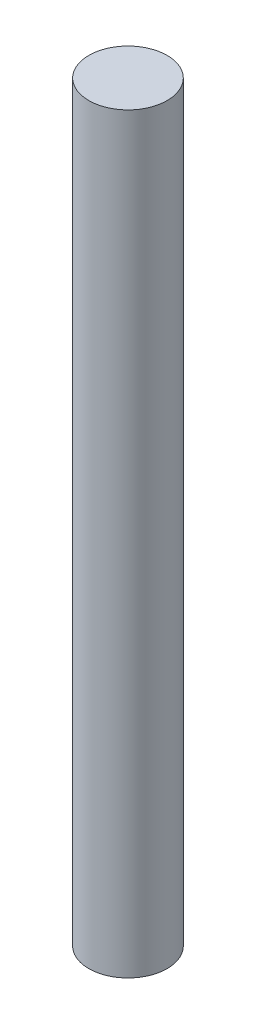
from build123d import *

# Parameters (mm, degrees)
SALIENTE_EXTRUIR1_DEPTH      = 8
SALIENTE_EXTRUIR1_DEPTH_BACK = 1.6
CROQUIS1_R                   = 0.5


with BuildPart() as part:
    # Croquis1 → Saliente-Extruir1 (new, two sides: drawn at the far end of the back side and taken through both)
    with BuildSketch(Plane(origin=(0, 0, 0), x_dir=(1, 0, 0), z_dir=(0, 1, 0)).offset(-SALIENTE_EXTRUIR1_DEPTH_BACK)):
        with Locations(Location((0, 0, 0), (0, 0, 270))):
            Circle(CROQUIS1_R)
    extrude(amount=SALIENTE_EXTRUIR1_DEPTH + SALIENTE_EXTRUIR1_DEPTH_BACK)


solid = part.part
